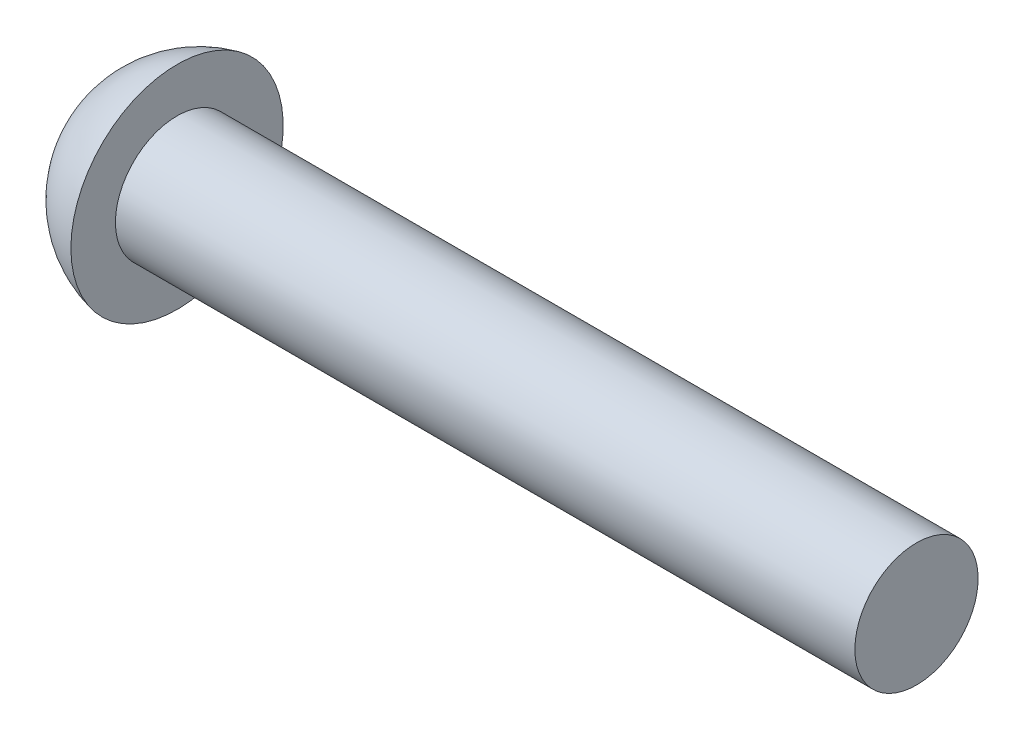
from build123d import *

# Parameters (mm, degrees)
RECPAT_COUNT = 2
RECPAT_ANGLE = 90


with BuildPart() as part:
    # BodySke → Base-Revolve (revolve)
    with BuildSketch(Plane.XY, mode=Mode.PRIVATE) as base_revolve_sk:
        with BuildLine():
            Line((3.5, 2.5), (3.5, 4.306971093))
            ThreePointArc((3.5, 4.306971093), (0.985325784, 2.774887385), (0, 0))
            Line((0, 0), (33.5, 0))
            Line((33.5, 0), (33.5, 2.5))
            Line((33.5, 2.5), (3.5, 2.5))
        make_face()
    revolve(base_revolve_sk.sketch.rotate(Axis((-25.4, 0, 0), (1, 0, 0)), 90), axis=Axis((-25.4, 0, 0), (1, 0, 0)))

    # Sketch3 → Recess section 0
    with BuildSketch(Plane(origin=(0, 0, 0), x_dir=(0, 0, -1), z_dir=(1, 0, 0))):
        with BuildLine():
            Line((0.35, -2.6), (-0.35, -2.6))
            Line((-0.35, -2.6), (-0.35, 2.6))
            Line((-0.35, 2.6), (0.35, 2.6))
            Line((0.35, 2.6), (0.35, -2.6))
        make_face()
    # Sketch4 → Recess section 1
    with BuildSketch(Plane(origin=(2.8, 0, 0), x_dir=(0, 0, -1), z_dir=(1, 0, 0))):
        with BuildLine():
            Line((0.35, -1.203971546), (-0.35, -1.203971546))
            Line((-0.35, -1.203971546), (-0.35, 1.203971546))
            Line((-0.35, 1.203971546), (0.35, 1.203971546))
            Line((0.35, 1.203971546), (0.35, -1.203971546))
        make_face()
    recess = loft(mode=Mode.SUBTRACT)

    # RecPat: Recess ×2 about axis
    recpat_axis = Axis((0, 0, 0), (1, 0, 0))
    for i in range(1, RECPAT_COUNT):
        add(recess.rotate(recpat_axis, i * RECPAT_ANGLE / (RECPAT_COUNT - 1)), mode=Mode.SUBTRACT)

    # RecCorSke → RecessCore (revolve, cut)
    with BuildSketch(Plane.XY, mode=Mode.PRIVATE) as recesscore_sk:
        Polygon((0, 0), (0, 1.046795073), (2.8, 0.851), (3.076506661, 0), align=None)
    revolve(recesscore_sk.sketch.rotate(Axis((-3.175, 0, 0), (1, 0, 0)), 351.256395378), axis=Axis((-3.175, 0, 0), (1, 0, 0)), mode=Mode.SUBTRACT)


solid = part.part
